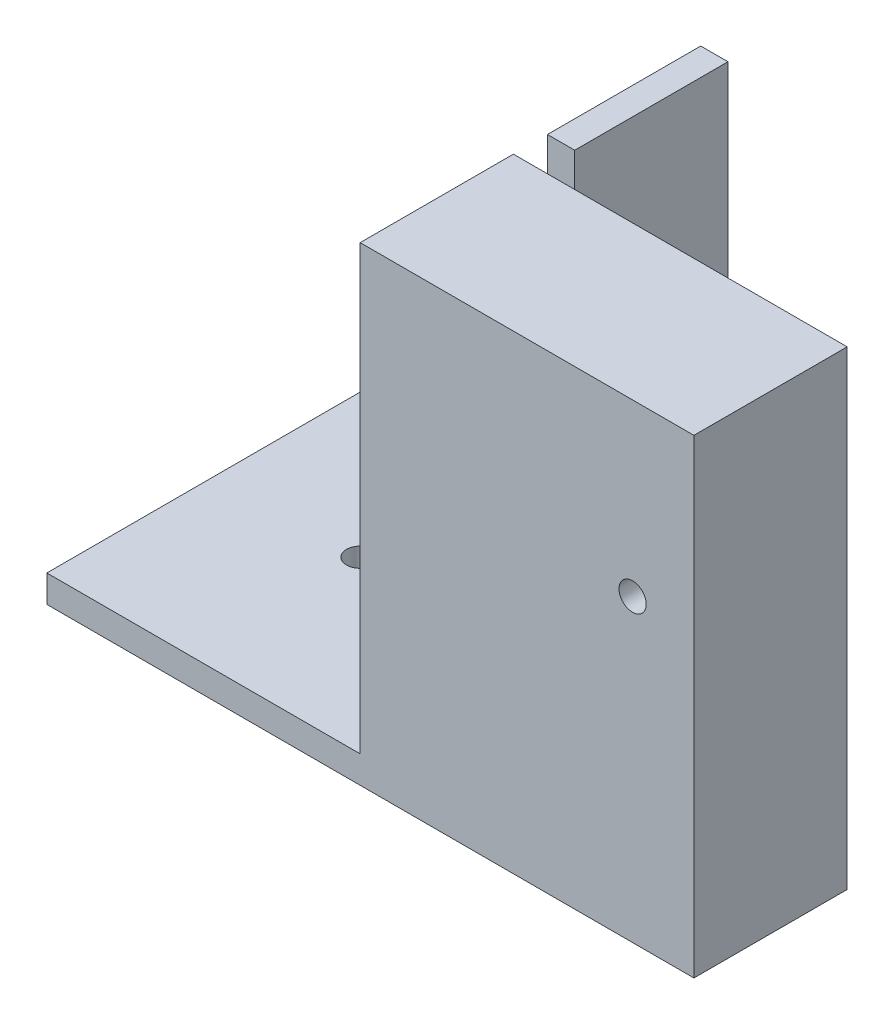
ISO-10303-21;
HEADER;
FILE_DESCRIPTION(('STEP AP214'),'2;1');
FILE_NAME('part.step','',(''),(''),'','','');
FILE_SCHEMA(('AUTOMOTIVE_DESIGN { 1 0 10303 214 1 1 1 1 }'));
ENDSEC;
DATA;
#1=APPLICATION_CONTEXT('core data for automotive mechanical design processes');
#2=APPLICATION_PROTOCOL_DEFINITION('international standard','automotive_design',2000,#1);
#3=PRODUCT_CONTEXT('',#1,'mechanical');
#4=PRODUCT('Part','Part','',(#3));
#5=PRODUCT_RELATED_PRODUCT_CATEGORY('part','',(#4));
#6=PRODUCT_DEFINITION_FORMATION('','',#4);
#7=PRODUCT_DEFINITION_CONTEXT('part definition',#1,'design');
#8=PRODUCT_DEFINITION('design','',#6,#7);
#9=PRODUCT_DEFINITION_SHAPE('','',#8);
#10=(LENGTH_UNIT() NAMED_UNIT(*) SI_UNIT(.MILLI.,.METRE.));
#11=(NAMED_UNIT(*) PLANE_ANGLE_UNIT() SI_UNIT($,.RADIAN.));
#12=(NAMED_UNIT(*) SI_UNIT($,.STERADIAN.) SOLID_ANGLE_UNIT());
#13=UNCERTAINTY_MEASURE_WITH_UNIT(LENGTH_MEASURE(1.E-05),#10,'distance_accuracy_value','');
#14=(GEOMETRIC_REPRESENTATION_CONTEXT(3) GLOBAL_UNCERTAINTY_ASSIGNED_CONTEXT((#13)) GLOBAL_UNIT_ASSIGNED_CONTEXT((#10,
#11,#12)) REPRESENTATION_CONTEXT('',''));
#15=CARTESIAN_POINT('',(0.,0.,0.));
#16=DIRECTION('',(0.,0.,1.));
#17=DIRECTION('',(1.,0.,0.));
#18=AXIS2_PLACEMENT_3D('',#15,#16,#17);
#19=CARTESIAN_POINT('',(13.1880053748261,136.304959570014,-50.));
#20=DIRECTION('',(1.,0.,0.));
#21=DIRECTION('',(0.,0.,-1.));
#22=AXIS2_PLACEMENT_3D('',#19,#20,#21);
#23=PLANE('',#22);
#24=DIRECTION('',(0.,0.,1.));
#25=VECTOR('',#24,1.);
#26=CARTESIAN_POINT('',(13.1880053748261,6.30495957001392,-50.));
#27=LINE('',#26,#25);
#28=CARTESIAN_POINT('',(13.1880053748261,6.30495957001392,-50.));
#29=VERTEX_POINT('',#28);
#30=CARTESIAN_POINT('',(13.1880053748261,6.30495957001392,-5.));
#31=VERTEX_POINT('',#30);
#32=EDGE_CURVE('E170',#29,#31,#27,.T.);
#33=ORIENTED_EDGE('',*,*,#32,.T.);
#34=DIRECTION('',(0.,1.,0.));
#35=VECTOR('',#34,1.);
#36=CARTESIAN_POINT('',(13.1880053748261,6.30495957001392,-5.));
#37=LINE('',#36,#35);
#38=CARTESIAN_POINT('',(13.1880053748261,136.304959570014,-5.));
#39=VERTEX_POINT('',#38);
#40=EDGE_CURVE('E160',#31,#39,#37,.T.);
#41=ORIENTED_EDGE('',*,*,#40,.T.);
#42=DIRECTION('',(0.,0.,1.));
#43=VECTOR('',#42,1.);
#44=CARTESIAN_POINT('',(13.1880053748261,136.304959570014,-50.));
#45=LINE('',#44,#43);
#46=CARTESIAN_POINT('',(13.1880053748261,136.304959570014,-50.));
#47=VERTEX_POINT('',#46);
#48=EDGE_CURVE('E173',#47,#39,#45,.T.);
#49=ORIENTED_EDGE('',*,*,#48,.F.);
#50=DIRECTION('',(0.,-1.,0.));
#51=VECTOR('',#50,1.);
#52=CARTESIAN_POINT('',(13.1880053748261,136.304959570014,-50.));
#53=LINE('',#52,#51);
#54=EDGE_CURVE('E238',#47,#29,#53,.T.);
#55=ORIENTED_EDGE('',*,*,#54,.T.);
#56=EDGE_LOOP('',(#33,#41,#49,#55));
#57=FACE_BOUND('',#56,.T.);
#58=ADVANCED_FACE('F34',(#57),#23,.F.);
#59=CARTESIAN_POINT('',(0.,136.304959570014,0.));
#60=DIRECTION('',(0.,-1.,0.));
#61=DIRECTION('',(0.,0.,-1.));
#62=AXIS2_PLACEMENT_3D('',#59,#60,#61);
#63=PLANE('',#62);
#64=ORIENTED_EDGE('',*,*,#48,.T.);
#65=DIRECTION('',(-1.,0.,0.));
#66=VECTOR('',#65,1.);
#67=CARTESIAN_POINT('',(13.1880053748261,136.304959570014,-5.));
#68=LINE('',#67,#66);
#69=CARTESIAN_POINT('',(21.1880053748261,136.304959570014,-5.));
#70=VERTEX_POINT('',#69);
#71=EDGE_CURVE('E126',#70,#39,#68,.T.);
#72=ORIENTED_EDGE('',*,*,#71,.F.);
#73=DIRECTION('',(0.,0.,-1.));
#74=VECTOR('',#73,1.);
#75=CARTESIAN_POINT('',(21.1880053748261,136.304959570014,-50.));
#76=LINE('',#75,#74);
#77=CARTESIAN_POINT('',(21.1880053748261,136.304959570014,-50.));
#78=VERTEX_POINT('',#77);
#79=EDGE_CURVE('E167',#70,#78,#76,.T.);
#80=ORIENTED_EDGE('',*,*,#79,.T.);
#81=DIRECTION('',(-1.,0.,0.));
#82=VECTOR('',#81,1.);
#83=CARTESIAN_POINT('',(21.1880053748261,136.304959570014,-50.));
#84=LINE('',#83,#82);
#85=EDGE_CURVE('E169',#78,#47,#84,.T.);
#86=ORIENTED_EDGE('',*,*,#85,.T.);
#87=EDGE_LOOP('',(#64,#72,#80,#86));
#88=FACE_BOUND('',#87,.T.);
#89=ADVANCED_FACE('F281',(#88),#63,.F.);
#90=CARTESIAN_POINT('',(-78.8119946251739,6.30495957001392,-50.));
#91=DIRECTION('',(-1.,0.,0.));
#92=DIRECTION('',(0.,0.,1.));
#93=AXIS2_PLACEMENT_3D('',#90,#91,#92);
#94=PLANE('',#93);
#95=DIRECTION('',(0.,0.,1.));
#96=VECTOR('',#95,1.);
#97=CARTESIAN_POINT('',(-78.8119946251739,-1.69504042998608,-50.));
#98=LINE('',#97,#96);
#99=CARTESIAN_POINT('',(-78.8119946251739,-1.69504042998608,-50.));
#100=VERTEX_POINT('',#99);
#101=CARTESIAN_POINT('',(-78.8119946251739,-1.69504042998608,50.));
#102=VERTEX_POINT('',#101);
#103=EDGE_CURVE('E193',#100,#102,#98,.T.);
#104=ORIENTED_EDGE('',*,*,#103,.T.);
#105=DIRECTION('',(0.,-1.,0.));
#106=VECTOR('',#105,1.);
#107=CARTESIAN_POINT('',(-78.8119946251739,6.30495957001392,50.));
#108=LINE('',#107,#106);
#109=CARTESIAN_POINT('',(-78.8119946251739,6.30495957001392,50.));
#110=VERTEX_POINT('',#109);
#111=EDGE_CURVE('E180',#110,#102,#108,.T.);
#112=ORIENTED_EDGE('',*,*,#111,.F.);
#113=DIRECTION('',(0.,0.,1.));
#114=VECTOR('',#113,1.);
#115=CARTESIAN_POINT('',(-78.8119946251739,6.30495957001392,-50.));
#116=LINE('',#115,#114);
#117=CARTESIAN_POINT('',(-78.8119946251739,6.30495957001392,-50.));
#118=VERTEX_POINT('',#117);
#119=EDGE_CURVE('E11',#118,#110,#116,.T.);
#120=ORIENTED_EDGE('',*,*,#119,.F.);
#121=DIRECTION('',(0.,-1.,0.));
#122=VECTOR('',#121,1.);
#123=CARTESIAN_POINT('',(-78.8119946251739,6.30495957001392,-50.));
#124=LINE('',#123,#122);
#125=EDGE_CURVE('E202',#118,#100,#124,.T.);
#126=ORIENTED_EDGE('',*,*,#125,.T.);
#127=EDGE_LOOP('',(#104,#112,#120,#126));
#128=FACE_BOUND('',#127,.T.);
#129=ADVANCED_FACE('F36',(#128),#94,.T.);
#130=CARTESIAN_POINT('',(-78.8119946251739,6.30495957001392,-50.));
#131=DIRECTION('',(0.,1.,0.));
#132=DIRECTION('',(0.,0.,1.));
#133=AXIS2_PLACEMENT_3D('',#130,#131,#132);
#134=PLANE('',#133);
#135=CARTESIAN_POINT('',(-36.8119946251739,6.30495957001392,0.));
#136=DIRECTION('',(0.,1.,0.));
#137=DIRECTION('',(0.,0.,1.));
#138=AXIS2_PLACEMENT_3D('',#135,#136,#137);
#139=CIRCLE('',#138,4.00000000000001);
#140=CARTESIAN_POINT('',(-36.8119946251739,6.30495957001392,4.00000000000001));
#141=VERTEX_POINT('',#140);
#142=EDGE_CURVE('E147',#141,#141,#139,.T.);
#143=ORIENTED_EDGE('',*,*,#142,.F.);
#144=EDGE_LOOP('',(#143));
#145=FACE_BOUND('',#144,.T.);
#146=ORIENTED_EDGE('',*,*,#32,.F.);
#147=DIRECTION('',(-1.,0.,0.));
#148=VECTOR('',#147,1.);
#149=CARTESIAN_POINT('',(-78.8119946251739,6.30495957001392,-50.));
#150=LINE('',#149,#148);
#151=EDGE_CURVE('E199',#29,#118,#150,.T.);
#152=ORIENTED_EDGE('',*,*,#151,.T.);
#153=ORIENTED_EDGE('',*,*,#119,.T.);
#154=DIRECTION('',(-1.,0.,0.));
#155=VECTOR('',#154,1.);
#156=CARTESIAN_POINT('',(-78.8119946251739,6.30495957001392,50.));
#157=LINE('',#156,#155);
#158=CARTESIAN_POINT('',(13.1880053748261,6.30495957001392,50.));
#159=VERTEX_POINT('',#158);
#160=EDGE_CURVE('E200',#159,#110,#157,.T.);
#161=ORIENTED_EDGE('',*,*,#160,.F.);
#162=CARTESIAN_POINT('',(13.1880053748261,6.30495957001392,5.));
#163=VERTEX_POINT('',#162);
#164=EDGE_CURVE('E163',#163,#159,#27,.T.);
#165=ORIENTED_EDGE('',*,*,#164,.F.);
#166=DIRECTION('',(1.,0.,0.));
#167=VECTOR('',#166,1.);
#168=CARTESIAN_POINT('',(13.1880053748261,6.30495957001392,5.));
#169=LINE('',#168,#167);
#170=CARTESIAN_POINT('',(21.1880053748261,6.30495957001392,5.));
#171=VERTEX_POINT('',#170);
#172=EDGE_CURVE('E159',#163,#171,#169,.T.);
#173=ORIENTED_EDGE('',*,*,#172,.T.);
#174=DIRECTION('',(0.,0.,-1.));
#175=VECTOR('',#174,1.);
#176=CARTESIAN_POINT('',(21.1880053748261,6.30495957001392,-5.));
#177=LINE('',#176,#175);
#178=CARTESIAN_POINT('',(21.1880053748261,6.30495957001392,-5.));
#179=VERTEX_POINT('',#178);
#180=EDGE_CURVE('E156',#171,#179,#177,.T.);
#181=ORIENTED_EDGE('',*,*,#180,.T.);
#182=DIRECTION('',(-1.,0.,0.));
#183=VECTOR('',#182,1.);
#184=CARTESIAN_POINT('',(13.1880053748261,6.30495957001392,-5.));
#185=LINE('',#184,#183);
#186=EDGE_CURVE('E154',#179,#31,#185,.T.);
#187=ORIENTED_EDGE('',*,*,#186,.T.);
#188=EDGE_LOOP('',(#146,#152,#153,#161,#165,#173,#181,#187));
#189=FACE_BOUND('',#188,.T.);
#190=ADVANCED_FACE('F220',(#145,#189),#134,.T.);
#191=CARTESIAN_POINT('',(21.1880053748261,6.30495957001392,-50.));
#192=DIRECTION('',(1.,0.,0.));
#193=DIRECTION('',(0.,0.,-1.));
#194=AXIS2_PLACEMENT_3D('',#191,#192,#193);
#195=PLANE('',#194);
#196=DIRECTION('',(0.,1.,0.));
#197=VECTOR('',#196,1.);
#198=CARTESIAN_POINT('',(21.1880053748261,136.304959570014,5.));
#199=LINE('',#198,#197);
#200=CARTESIAN_POINT('',(21.1880053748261,-1.69504042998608,5.));
#201=VERTEX_POINT('',#200);
#202=EDGE_CURVE('E51',#201,#171,#199,.T.);
#203=ORIENTED_EDGE('',*,*,#202,.F.);
#204=DIRECTION('',(0.,0.,1.));
#205=VECTOR('',#204,1.);
#206=CARTESIAN_POINT('',(21.1880053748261,-1.69504042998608,-50.));
#207=LINE('',#206,#205);
#208=CARTESIAN_POINT('',(21.1880053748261,-1.69504042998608,-50.));
#209=VERTEX_POINT('',#208);
#210=EDGE_CURVE('E43',#209,#201,#207,.T.);
#211=ORIENTED_EDGE('',*,*,#210,.F.);
#212=DIRECTION('',(0.,1.,0.));
#213=VECTOR('',#212,1.);
#214=CARTESIAN_POINT('',(21.1880053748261,6.30495957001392,-50.));
#215=LINE('',#214,#213);
#216=EDGE_CURVE('E211',#209,#78,#215,.T.);
#217=ORIENTED_EDGE('',*,*,#216,.T.);
#218=ORIENTED_EDGE('',*,*,#79,.F.);
#219=DIRECTION('',(0.,1.,0.));
#220=VECTOR('',#219,1.);
#221=CARTESIAN_POINT('',(21.1880053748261,6.30495957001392,-5.));
#222=LINE('',#221,#220);
#223=EDGE_CURVE('E164',#179,#70,#222,.T.);
#224=ORIENTED_EDGE('',*,*,#223,.F.);
#225=ORIENTED_EDGE('',*,*,#180,.F.);
#226=EDGE_LOOP('',(#203,#211,#217,#218,#224,#225));
#227=FACE_BOUND('',#226,.T.);
#228=ADVANCED_FACE('F249',(#227),#195,.T.);
#229=CARTESIAN_POINT('',(-78.8119946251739,-1.69504042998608,-50.));
#230=DIRECTION('',(0.,-1.,0.));
#231=DIRECTION('',(0.,0.,-1.));
#232=AXIS2_PLACEMENT_3D('',#229,#230,#231);
#233=PLANE('',#232);
#234=CARTESIAN_POINT('',(-36.8119946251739,-1.69504042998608,0.));
#235=DIRECTION('',(0.,-1.,0.));
#236=DIRECTION('',(0.,0.,-1.));
#237=AXIS2_PLACEMENT_3D('',#234,#235,#236);
#238=CIRCLE('',#237,4.00000000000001);
#239=CARTESIAN_POINT('',(-36.8119946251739,-1.69504042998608,-4.00000000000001));
#240=VERTEX_POINT('',#239);
#241=EDGE_CURVE('E144',#240,#240,#238,.T.);
#242=ORIENTED_EDGE('',*,*,#241,.F.);
#243=EDGE_LOOP('',(#242));
#244=FACE_BOUND('',#243,.T.);
#245=ORIENTED_EDGE('',*,*,#210,.T.);
#246=DIRECTION('',(-1.,0.,0.));
#247=VECTOR('',#246,1.);
#248=CARTESIAN_POINT('',(111.188005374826,-1.69504042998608,4.99999999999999));
#249=LINE('',#248,#247);
#250=CARTESIAN_POINT('',(111.188005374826,-1.69504042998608,4.99999999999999));
#251=VERTEX_POINT('',#250);
#252=EDGE_CURVE('E127',#251,#201,#249,.T.);
#253=ORIENTED_EDGE('',*,*,#252,.F.);
#254=DIRECTION('',(0.,0.,-1.));
#255=VECTOR('',#254,1.);
#256=CARTESIAN_POINT('',(111.188005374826,-1.69504042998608,4.99999999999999));
#257=LINE('',#256,#255);
#258=CARTESIAN_POINT('',(111.188005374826,-1.69504042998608,50.));
#259=VERTEX_POINT('',#258);
#260=EDGE_CURVE('E141',#259,#251,#257,.T.);
#261=ORIENTED_EDGE('',*,*,#260,.F.);
#262=DIRECTION('',(1.,0.,0.));
#263=VECTOR('',#262,1.);
#264=CARTESIAN_POINT('',(-78.8119946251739,-1.69504042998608,50.));
#265=LINE('',#264,#263);
#266=EDGE_CURVE('E203',#102,#259,#265,.T.);
#267=ORIENTED_EDGE('',*,*,#266,.F.);
#268=ORIENTED_EDGE('',*,*,#103,.F.);
#269=DIRECTION('',(1.,0.,0.));
#270=VECTOR('',#269,1.);
#271=CARTESIAN_POINT('',(-78.8119946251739,-1.69504042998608,-50.));
#272=LINE('',#271,#270);
#273=EDGE_CURVE('E208',#100,#209,#272,.T.);
#274=ORIENTED_EDGE('',*,*,#273,.T.);
#275=EDGE_LOOP('',(#245,#253,#261,#267,#268,#274));
#276=FACE_BOUND('',#275,.T.);
#277=ADVANCED_FACE('F233',(#244,#276),#233,.T.);
#278=CARTESIAN_POINT('',(0.,0.,-50.));
#279=DIRECTION('',(0.,0.,1.));
#280=DIRECTION('',(1.,0.,0.));
#281=AXIS2_PLACEMENT_3D('',#278,#279,#280);
#282=PLANE('',#281);
#283=ORIENTED_EDGE('',*,*,#125,.F.);
#284=ORIENTED_EDGE('',*,*,#151,.F.);
#285=ORIENTED_EDGE('',*,*,#54,.F.);
#286=ORIENTED_EDGE('',*,*,#85,.F.);
#287=ORIENTED_EDGE('',*,*,#216,.F.);
#288=ORIENTED_EDGE('',*,*,#273,.F.);
#289=EDGE_LOOP('',(#283,#284,#285,#286,#287,#288));
#290=FACE_BOUND('',#289,.T.);
#291=ADVANCED_FACE('F231',(#290),#282,.F.);
#292=CARTESIAN_POINT('',(0.,0.,50.));
#293=DIRECTION('',(0.,0.,1.));
#294=DIRECTION('',(1.,0.,0.));
#295=AXIS2_PLACEMENT_3D('',#292,#293,#294);
#296=PLANE('',#295);
#297=CARTESIAN_POINT('',(93.1880053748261,86.3049595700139,50.));
#298=DIRECTION('',(0.,0.,1.));
#299=DIRECTION('',(1.,0.,0.));
#300=AXIS2_PLACEMENT_3D('',#297,#298,#299);
#301=CIRCLE('',#300,4.00000000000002);
#302=CARTESIAN_POINT('',(97.1880053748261,86.3049595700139,50.));
#303=VERTEX_POINT('',#302);
#304=EDGE_CURVE('E263',#303,#303,#301,.T.);
#305=ORIENTED_EDGE('',*,*,#304,.F.);
#306=EDGE_LOOP('',(#305));
#307=FACE_BOUND('',#306,.T.);
#308=ORIENTED_EDGE('',*,*,#111,.T.);
#309=ORIENTED_EDGE('',*,*,#266,.T.);
#310=DIRECTION('',(0.,-1.,0.));
#311=VECTOR('',#310,1.);
#312=CARTESIAN_POINT('',(111.188005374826,136.304959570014,50.));
#313=LINE('',#312,#311);
#314=CARTESIAN_POINT('',(111.188005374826,136.304959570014,50.));
#315=VERTEX_POINT('',#314);
#316=EDGE_CURVE('E137',#315,#259,#313,.T.);
#317=ORIENTED_EDGE('',*,*,#316,.F.);
#318=DIRECTION('',(1.,0.,0.));
#319=VECTOR('',#318,1.);
#320=CARTESIAN_POINT('',(21.1880053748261,136.304959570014,50.));
#321=LINE('',#320,#319);
#322=CARTESIAN_POINT('',(13.1880053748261,136.304959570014,50.));
#323=VERTEX_POINT('',#322);
#324=EDGE_CURVE('E133',#323,#315,#321,.T.);
#325=ORIENTED_EDGE('',*,*,#324,.F.);
#326=DIRECTION('',(0.,-1.,0.));
#327=VECTOR('',#326,1.);
#328=CARTESIAN_POINT('',(13.1880053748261,136.304959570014,50.));
#329=LINE('',#328,#327);
#330=EDGE_CURVE('E177',#323,#159,#329,.T.);
#331=ORIENTED_EDGE('',*,*,#330,.T.);
#332=ORIENTED_EDGE('',*,*,#160,.T.);
#333=EDGE_LOOP('',(#308,#309,#317,#325,#331,#332));
#334=FACE_BOUND('',#333,.T.);
#335=ADVANCED_FACE('F236',(#307,#334),#296,.T.);
#336=CARTESIAN_POINT('',(13.1880053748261,136.304959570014,5.));
#337=VERTEX_POINT('',#336);
#338=EDGE_CURVE('E172',#337,#323,#45,.T.);
#339=ORIENTED_EDGE('',*,*,#338,.F.);
#340=DIRECTION('',(0.,1.,0.));
#341=VECTOR('',#340,1.);
#342=CARTESIAN_POINT('',(13.1880053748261,6.30495957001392,5.));
#343=LINE('',#342,#341);
#344=EDGE_CURVE('E59',#163,#337,#343,.T.);
#345=ORIENTED_EDGE('',*,*,#344,.F.);
#346=ORIENTED_EDGE('',*,*,#164,.T.);
#347=ORIENTED_EDGE('',*,*,#330,.F.);
#348=EDGE_LOOP('',(#339,#345,#346,#347));
#349=FACE_BOUND('',#348,.T.);
#350=ADVANCED_FACE('F245',(#349),#23,.F.);
#351=ORIENTED_EDGE('',*,*,#324,.T.);
#352=DIRECTION('',(0.,0.,1.));
#353=VECTOR('',#352,1.);
#354=CARTESIAN_POINT('',(111.188005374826,136.304959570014,5.));
#355=LINE('',#354,#353);
#356=CARTESIAN_POINT('',(111.188005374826,136.304959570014,5.));
#357=VERTEX_POINT('',#356);
#358=EDGE_CURVE('E130',#357,#315,#355,.T.);
#359=ORIENTED_EDGE('',*,*,#358,.F.);
#360=DIRECTION('',(1.,0.,0.));
#361=VECTOR('',#360,1.);
#362=CARTESIAN_POINT('',(13.1880053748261,136.304959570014,5.));
#363=LINE('',#362,#361);
#364=EDGE_CURVE('E118',#337,#357,#363,.T.);
#365=ORIENTED_EDGE('',*,*,#364,.F.);
#366=ORIENTED_EDGE('',*,*,#338,.T.);
#367=EDGE_LOOP('',(#351,#359,#365,#366));
#368=FACE_BOUND('',#367,.T.);
#369=ADVANCED_FACE('F131',(#368),#63,.F.);
#370=CARTESIAN_POINT('',(13.1880053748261,6.30495957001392,-5.));
#371=DIRECTION('',(0.,0.,-1.));
#372=DIRECTION('',(-1.,0.,0.));
#373=AXIS2_PLACEMENT_3D('',#370,#371,#372);
#374=PLANE('',#373);
#375=ORIENTED_EDGE('',*,*,#71,.T.);
#376=ORIENTED_EDGE('',*,*,#40,.F.);
#377=ORIENTED_EDGE('',*,*,#186,.F.);
#378=ORIENTED_EDGE('',*,*,#223,.T.);
#379=EDGE_LOOP('',(#375,#376,#377,#378));
#380=FACE_BOUND('',#379,.T.);
#381=ADVANCED_FACE('F289',(#380),#374,.F.);
#382=CARTESIAN_POINT('',(13.1880053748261,6.30495957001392,5.));
#383=DIRECTION('',(0.,0.,1.));
#384=DIRECTION('',(1.,0.,0.));
#385=AXIS2_PLACEMENT_3D('',#382,#383,#384);
#386=PLANE('',#385);
#387=CARTESIAN_POINT('',(93.1880053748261,86.3049595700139,5.));
#388=DIRECTION('',(0.,0.,1.));
#389=DIRECTION('',(1.,0.,0.));
#390=AXIS2_PLACEMENT_3D('',#387,#388,#389);
#391=CIRCLE('',#390,4.00000000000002);
#392=CARTESIAN_POINT('',(97.1880053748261,86.3049595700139,5.));
#393=VERTEX_POINT('',#392);
#394=EDGE_CURVE('E38',#393,#393,#391,.T.);
#395=ORIENTED_EDGE('',*,*,#394,.T.);
#396=EDGE_LOOP('',(#395));
#397=FACE_BOUND('',#396,.T.);
#398=ORIENTED_EDGE('',*,*,#364,.T.);
#399=DIRECTION('',(0.,1.,0.));
#400=VECTOR('',#399,1.);
#401=CARTESIAN_POINT('',(111.188005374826,136.304959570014,5.));
#402=LINE('',#401,#400);
#403=EDGE_CURVE('E123',#251,#357,#402,.T.);
#404=ORIENTED_EDGE('',*,*,#403,.F.);
#405=ORIENTED_EDGE('',*,*,#252,.T.);
#406=ORIENTED_EDGE('',*,*,#202,.T.);
#407=ORIENTED_EDGE('',*,*,#172,.F.);
#408=ORIENTED_EDGE('',*,*,#344,.T.);
#409=EDGE_LOOP('',(#398,#404,#405,#406,#407,#408));
#410=FACE_BOUND('',#409,.T.);
#411=ADVANCED_FACE('F120',(#397,#410),#386,.F.);
#412=CARTESIAN_POINT('',(111.188005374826,0.,0.));
#413=DIRECTION('',(-1.,0.,0.));
#414=DIRECTION('',(0.,0.,1.));
#415=AXIS2_PLACEMENT_3D('',#412,#413,#414);
#416=PLANE('',#415);
#417=ORIENTED_EDGE('',*,*,#403,.T.);
#418=ORIENTED_EDGE('',*,*,#358,.T.);
#419=ORIENTED_EDGE('',*,*,#316,.T.);
#420=ORIENTED_EDGE('',*,*,#260,.T.);
#421=EDGE_LOOP('',(#417,#418,#419,#420));
#422=FACE_BOUND('',#421,.T.);
#423=ADVANCED_FACE('F139',(#422),#416,.F.);
#424=CARTESIAN_POINT('',(-36.8119946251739,-43.6950404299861,0.));
#425=DIRECTION('',(0.,1.,0.));
#426=DIRECTION('',(0.,0.,1.));
#427=AXIS2_PLACEMENT_3D('',#424,#425,#426);
#428=CYLINDRICAL_SURFACE('',#427,4.00000000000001);
#429=ORIENTED_EDGE('',*,*,#241,.T.);
#430=EDGE_LOOP('',(#429));
#431=FACE_BOUND('',#430,.T.);
#432=ORIENTED_EDGE('',*,*,#142,.T.);
#433=EDGE_LOOP('',(#432));
#434=FACE_BOUND('',#433,.T.);
#435=ADVANCED_FACE('F297',(#431,#434),#428,.F.);
#436=CARTESIAN_POINT('',(93.1880053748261,86.3049595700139,0.));
#437=DIRECTION('',(0.,0.,1.));
#438=DIRECTION('',(1.,0.,0.));
#439=AXIS2_PLACEMENT_3D('',#436,#437,#438);
#440=CYLINDRICAL_SURFACE('',#439,4.00000000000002);
#441=ORIENTED_EDGE('',*,*,#304,.T.);
#442=EDGE_LOOP('',(#441));
#443=FACE_BOUND('',#442,.T.);
#444=ORIENTED_EDGE('',*,*,#394,.F.);
#445=EDGE_LOOP('',(#444));
#446=FACE_BOUND('',#445,.T.);
#447=ADVANCED_FACE('F269',(#443,#446),#440,.F.);
#448=CLOSED_SHELL('',(#58,#89,#129,#190,#228,#277,#291,#335,#350,#369,#381,#411,#423,#435,#447));
#449=MANIFOLD_SOLID_BREP('B2',#448);
#450=ADVANCED_BREP_SHAPE_REPRESENTATION('',(#18,#449),#14);
#451=SHAPE_DEFINITION_REPRESENTATION(#9,#450);
ENDSEC;
END-ISO-10303-21;
